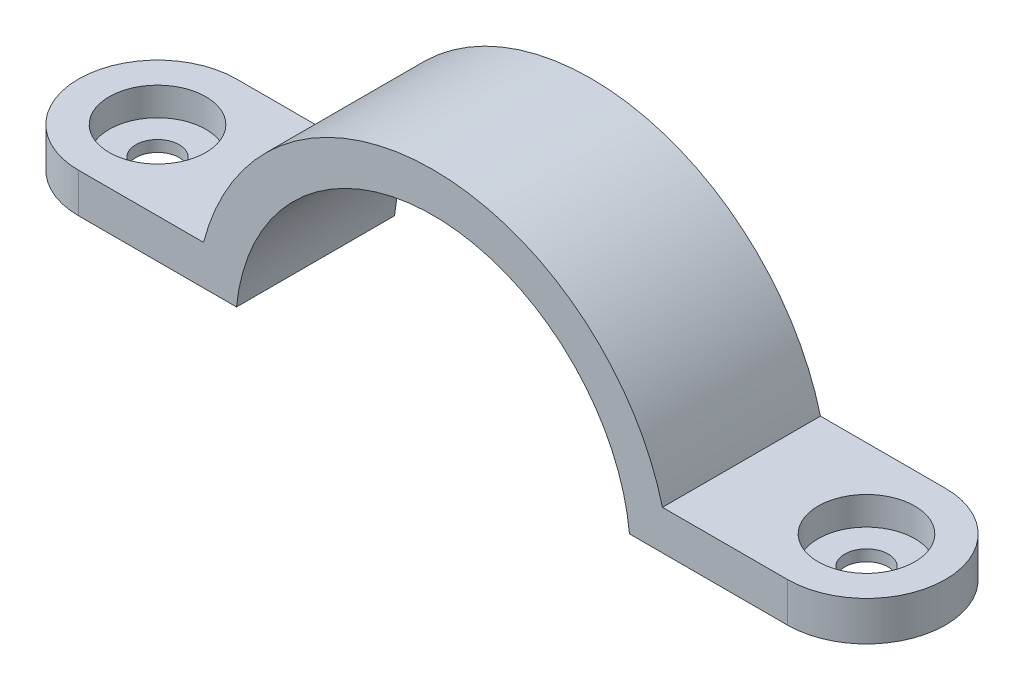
ISO-10303-21;
HEADER;
FILE_DESCRIPTION(('STEP AP214'),'2;1');
FILE_NAME('part.step','',(''),(''),'','','');
FILE_SCHEMA(('AUTOMOTIVE_DESIGN { 1 0 10303 214 1 1 1 1 }'));
ENDSEC;
DATA;
#1=APPLICATION_CONTEXT('core data for automotive mechanical design processes');
#2=APPLICATION_PROTOCOL_DEFINITION('international standard','automotive_design',2000,#1);
#3=PRODUCT_CONTEXT('',#1,'mechanical');
#4=PRODUCT('Part','Part','',(#3));
#5=PRODUCT_RELATED_PRODUCT_CATEGORY('part','',(#4));
#6=PRODUCT_DEFINITION_FORMATION('','',#4);
#7=PRODUCT_DEFINITION_CONTEXT('part definition',#1,'design');
#8=PRODUCT_DEFINITION('design','',#6,#7);
#9=PRODUCT_DEFINITION_SHAPE('','',#8);
#10=(LENGTH_UNIT() NAMED_UNIT(*) SI_UNIT(.MILLI.,.METRE.));
#11=(NAMED_UNIT(*) PLANE_ANGLE_UNIT() SI_UNIT($,.RADIAN.));
#12=(NAMED_UNIT(*) SI_UNIT($,.STERADIAN.) SOLID_ANGLE_UNIT());
#13=UNCERTAINTY_MEASURE_WITH_UNIT(LENGTH_MEASURE(1.E-05),#10,'distance_accuracy_value','');
#14=(GEOMETRIC_REPRESENTATION_CONTEXT(3) GLOBAL_UNCERTAINTY_ASSIGNED_CONTEXT((#13)) GLOBAL_UNIT_ASSIGNED_CONTEXT((#10,
#11,#12)) REPRESENTATION_CONTEXT('',''));
#15=CARTESIAN_POINT('',(0.,0.,0.));
#16=DIRECTION('',(0.,0.,1.));
#17=DIRECTION('',(1.,0.,0.));
#18=AXIS2_PLACEMENT_3D('',#15,#16,#17);
#19=CARTESIAN_POINT('',(24.8746859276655,2.5,10.));
#20=DIRECTION('',(0.,-1.,0.));
#21=DIRECTION('',(0.,0.,-1.));
#22=AXIS2_PLACEMENT_3D('',#19,#20,#21);
#23=PLANE('',#22);
#24=DIRECTION('',(-1.,0.,0.));
#25=VECTOR('',#24,1.);
#26=CARTESIAN_POINT('',(24.8746859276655,2.5,-10.));
#27=LINE('',#26,#25);
#28=CARTESIAN_POINT('',(44.8746859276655,2.5,-10.));
#29=VERTEX_POINT('',#28);
#30=CARTESIAN_POINT('',(24.8746859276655,2.5,-10.));
#31=VERTEX_POINT('',#30);
#32=EDGE_CURVE('E117',#29,#31,#27,.T.);
#33=ORIENTED_EDGE('',*,*,#32,.F.);
#34=CARTESIAN_POINT('',(44.8746859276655,2.5,0.));
#35=DIRECTION('',(0.,-1.,0.));
#36=DIRECTION('',(0.,0.,-1.));
#37=AXIS2_PLACEMENT_3D('',#34,#35,#36);
#38=CIRCLE('',#37,10.);
#39=CARTESIAN_POINT('',(44.8746859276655,2.5,10.));
#40=VERTEX_POINT('',#39);
#41=EDGE_CURVE('E150',#29,#40,#38,.T.);
#42=ORIENTED_EDGE('',*,*,#41,.T.);
#43=DIRECTION('',(-1.,0.,0.));
#44=VECTOR('',#43,1.);
#45=CARTESIAN_POINT('',(24.8746859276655,2.5,10.));
#46=LINE('',#45,#44);
#47=CARTESIAN_POINT('',(24.8746859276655,2.5,10.));
#48=VERTEX_POINT('',#47);
#49=EDGE_CURVE('E133',#40,#48,#46,.T.);
#50=ORIENTED_EDGE('',*,*,#49,.T.);
#51=DIRECTION('',(0.,0.,-1.));
#52=VECTOR('',#51,1.);
#53=CARTESIAN_POINT('',(24.8746859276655,2.5,10.));
#54=LINE('',#53,#52);
#55=EDGE_CURVE('E105',#48,#31,#54,.T.);
#56=ORIENTED_EDGE('',*,*,#55,.T.);
#57=EDGE_LOOP('',(#33,#42,#50,#56));
#58=FACE_BOUND('',#57,.T.);
#59=CARTESIAN_POINT('',(44.8746859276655,2.5,0.));
#60=DIRECTION('',(0.,1.,0.));
#61=DIRECTION('',(0.,0.,1.));
#62=AXIS2_PLACEMENT_3D('',#59,#60,#61);
#63=CIRCLE('',#62,2.75);
#64=CARTESIAN_POINT('',(44.8746859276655,2.5,2.75));
#65=VERTEX_POINT('',#64);
#66=EDGE_CURVE('E195',#65,#65,#63,.T.);
#67=ORIENTED_EDGE('',*,*,#66,.T.);
#68=EDGE_LOOP('',(#67));
#69=FACE_BOUND('',#68,.T.);
#70=ADVANCED_FACE('F33',(#58,#69),#23,.T.);
#71=CARTESIAN_POINT('',(-24.8746859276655,2.5,10.));
#72=DIRECTION('',(0.,-1.,0.));
#73=DIRECTION('',(0.,0.,-1.));
#74=AXIS2_PLACEMENT_3D('',#71,#72,#73);
#75=PLANE('',#74);
#76=DIRECTION('',(-1.,0.,0.));
#77=VECTOR('',#76,1.);
#78=CARTESIAN_POINT('',(-24.8746859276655,2.5,10.));
#79=LINE('',#78,#77);
#80=CARTESIAN_POINT('',(-24.8746859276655,2.5,10.));
#81=VERTEX_POINT('',#80);
#82=CARTESIAN_POINT('',(-44.8746859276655,2.5,10.));
#83=VERTEX_POINT('',#82);
#84=EDGE_CURVE('E130',#81,#83,#79,.T.);
#85=ORIENTED_EDGE('',*,*,#84,.T.);
#86=CARTESIAN_POINT('',(-44.8746859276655,2.5,0.));
#87=DIRECTION('',(0.,-1.,0.));
#88=DIRECTION('',(0.,0.,-1.));
#89=AXIS2_PLACEMENT_3D('',#86,#87,#88);
#90=CIRCLE('',#89,10.);
#91=CARTESIAN_POINT('',(-44.8746859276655,2.5,-10.));
#92=VERTEX_POINT('',#91);
#93=EDGE_CURVE('E11',#83,#92,#90,.T.);
#94=ORIENTED_EDGE('',*,*,#93,.T.);
#95=DIRECTION('',(-1.,0.,0.));
#96=VECTOR('',#95,1.);
#97=CARTESIAN_POINT('',(-24.8746859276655,2.5,-10.));
#98=LINE('',#97,#96);
#99=CARTESIAN_POINT('',(-24.8746859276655,2.5,-10.));
#100=VERTEX_POINT('',#99);
#101=EDGE_CURVE('E108',#100,#92,#98,.T.);
#102=ORIENTED_EDGE('',*,*,#101,.F.);
#103=DIRECTION('',(0.,0.,-1.));
#104=VECTOR('',#103,1.);
#105=CARTESIAN_POINT('',(-24.8746859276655,2.5,10.));
#106=LINE('',#105,#104);
#107=EDGE_CURVE('E96',#81,#100,#106,.T.);
#108=ORIENTED_EDGE('',*,*,#107,.F.);
#109=EDGE_LOOP('',(#85,#94,#102,#108));
#110=FACE_BOUND('',#109,.T.);
#111=CARTESIAN_POINT('',(-44.8746859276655,2.5,0.));
#112=DIRECTION('',(0.,1.,0.));
#113=DIRECTION('',(0.,0.,1.));
#114=AXIS2_PLACEMENT_3D('',#111,#112,#113);
#115=CIRCLE('',#114,2.75);
#116=CARTESIAN_POINT('',(-44.8746859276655,2.5,2.75));
#117=VERTEX_POINT('',#116);
#118=EDGE_CURVE('E183',#117,#117,#115,.T.);
#119=ORIENTED_EDGE('',*,*,#118,.T.);
#120=EDGE_LOOP('',(#119));
#121=FACE_BOUND('',#120,.T.);
#122=ADVANCED_FACE('F109',(#110,#121),#75,.T.);
#123=CARTESIAN_POINT('',(-44.8746859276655,7.5,0.));
#124=DIRECTION('',(0.,1.,0.));
#125=DIRECTION('',(0.,0.,1.));
#126=AXIS2_PLACEMENT_3D('',#123,#124,#125);
#127=CYLINDRICAL_SURFACE('',#126,10.);
#128=DIRECTION('',(0.,1.,0.));
#129=VECTOR('',#128,1.);
#130=CARTESIAN_POINT('',(-44.8746859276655,0.,10.));
#131=LINE('',#130,#129);
#132=CARTESIAN_POINT('',(-44.8746859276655,7.5,10.));
#133=VERTEX_POINT('',#132);
#134=EDGE_CURVE('E154',#133,#83,#131,.F.);
#135=ORIENTED_EDGE('',*,*,#134,.F.);
#136=CARTESIAN_POINT('',(-44.8746859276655,7.5,0.));
#137=DIRECTION('',(0.,-1.,0.));
#138=DIRECTION('',(0.,0.,-1.));
#139=AXIS2_PLACEMENT_3D('',#136,#137,#138);
#140=CIRCLE('',#139,10.);
#141=CARTESIAN_POINT('',(-44.8746859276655,7.5,-10.));
#142=VERTEX_POINT('',#141);
#143=EDGE_CURVE('E41',#142,#133,#140,.F.);
#144=ORIENTED_EDGE('',*,*,#143,.F.);
#145=DIRECTION('',(0.,-1.,0.));
#146=VECTOR('',#145,1.);
#147=CARTESIAN_POINT('',(-44.8746859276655,7.5,-10.));
#148=LINE('',#147,#146);
#149=EDGE_CURVE('E157',#92,#142,#148,.F.);
#150=ORIENTED_EDGE('',*,*,#149,.F.);
#151=ORIENTED_EDGE('',*,*,#93,.F.);
#152=EDGE_LOOP('',(#135,#144,#150,#151));
#153=FACE_BOUND('',#152,.T.);
#154=ADVANCED_FACE('F35',(#153),#127,.T.);
#155=CARTESIAN_POINT('',(44.8746859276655,2.5,0.));
#156=DIRECTION('',(0.,-1.,0.));
#157=DIRECTION('',(0.,0.,-1.));
#158=AXIS2_PLACEMENT_3D('',#155,#156,#157);
#159=CYLINDRICAL_SURFACE('',#158,10.);
#160=DIRECTION('',(0.,-1.,0.));
#161=VECTOR('',#160,1.);
#162=CARTESIAN_POINT('',(44.8746859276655,0.,10.));
#163=LINE('',#162,#161);
#164=CARTESIAN_POINT('',(44.8746859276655,7.5,10.));
#165=VERTEX_POINT('',#164);
#166=EDGE_CURVE('E104',#40,#165,#163,.F.);
#167=ORIENTED_EDGE('',*,*,#166,.F.);
#168=ORIENTED_EDGE('',*,*,#41,.F.);
#169=DIRECTION('',(0.,1.,0.));
#170=VECTOR('',#169,1.);
#171=CARTESIAN_POINT('',(44.8746859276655,2.5,-10.));
#172=LINE('',#171,#170);
#173=CARTESIAN_POINT('',(44.8746859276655,7.5,-10.));
#174=VERTEX_POINT('',#173);
#175=EDGE_CURVE('E148',#174,#29,#172,.F.);
#176=ORIENTED_EDGE('',*,*,#175,.F.);
#177=CARTESIAN_POINT('',(44.8746859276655,7.5,0.));
#178=DIRECTION('',(0.,-1.,0.));
#179=DIRECTION('',(0.,0.,-1.));
#180=AXIS2_PLACEMENT_3D('',#177,#178,#179);
#181=CIRCLE('',#180,10.);
#182=EDGE_CURVE('E152',#165,#174,#181,.F.);
#183=ORIENTED_EDGE('',*,*,#182,.F.);
#184=EDGE_LOOP('',(#167,#168,#176,#183));
#185=FACE_BOUND('',#184,.T.);
#186=ADVANCED_FACE('F228',(#185),#159,.T.);
#187=CARTESIAN_POINT('',(-24.8746859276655,7.5,10.));
#188=DIRECTION('',(0.,-1.,0.));
#189=DIRECTION('',(0.,0.,-1.));
#190=AXIS2_PLACEMENT_3D('',#187,#188,#189);
#191=PLANE('',#190);
#192=CARTESIAN_POINT('',(-44.8746859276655,7.5,0.));
#193=DIRECTION('',(0.,1.,0.));
#194=DIRECTION('',(0.,0.,1.));
#195=AXIS2_PLACEMENT_3D('',#192,#193,#194);
#196=CIRCLE('',#195,6.12);
#197=CARTESIAN_POINT('',(-44.8746859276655,7.5,6.12));
#198=VERTEX_POINT('',#197);
#199=EDGE_CURVE('E173',#198,#198,#196,.T.);
#200=ORIENTED_EDGE('',*,*,#199,.F.);
#201=EDGE_LOOP('',(#200));
#202=FACE_BOUND('',#201,.T.);
#203=DIRECTION('',(1.,0.,0.));
#204=VECTOR('',#203,1.);
#205=CARTESIAN_POINT('',(-24.8746859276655,7.5,-10.));
#206=LINE('',#205,#204);
#207=CARTESIAN_POINT('',(-29.0473750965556,7.5,-10.));
#208=VERTEX_POINT('',#207);
#209=EDGE_CURVE('E112',#208,#142,#206,.F.);
#210=ORIENTED_EDGE('',*,*,#209,.T.);
#211=ORIENTED_EDGE('',*,*,#143,.T.);
#212=DIRECTION('',(1.,0.,0.));
#213=VECTOR('',#212,1.);
#214=CARTESIAN_POINT('',(-24.8746859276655,7.5,10.));
#215=LINE('',#214,#213);
#216=CARTESIAN_POINT('',(-29.0473750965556,7.5,10.));
#217=VERTEX_POINT('',#216);
#218=EDGE_CURVE('E127',#217,#133,#215,.F.);
#219=ORIENTED_EDGE('',*,*,#218,.F.);
#220=DIRECTION('',(0.,0.,-1.));
#221=VECTOR('',#220,1.);
#222=CARTESIAN_POINT('',(-29.0473750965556,7.5,10.));
#223=LINE('',#222,#221);
#224=EDGE_CURVE('E139',#217,#208,#223,.T.);
#225=ORIENTED_EDGE('',*,*,#224,.T.);
#226=EDGE_LOOP('',(#210,#211,#219,#225));
#227=FACE_BOUND('',#226,.T.);
#228=ADVANCED_FACE('F161',(#202,#227),#191,.F.);
#229=CARTESIAN_POINT('',(0.,0.,10.));
#230=DIRECTION('',(0.,0.,-1.));
#231=DIRECTION('',(-1.,0.,0.));
#232=AXIS2_PLACEMENT_3D('',#229,#230,#231);
#233=CYLINDRICAL_SURFACE('',#232,25.);
#234=CARTESIAN_POINT('',(0.,0.,-10.));
#235=DIRECTION('',(0.,0.,1.));
#236=DIRECTION('',(1.,0.,0.));
#237=AXIS2_PLACEMENT_3D('',#234,#235,#236);
#238=CIRCLE('',#237,25.);
#239=EDGE_CURVE('E100',#31,#100,#238,.T.);
#240=ORIENTED_EDGE('',*,*,#239,.F.);
#241=ORIENTED_EDGE('',*,*,#55,.F.);
#242=CARTESIAN_POINT('',(0.,0.,10.));
#243=DIRECTION('',(0.,0.,1.));
#244=DIRECTION('',(1.,0.,0.));
#245=AXIS2_PLACEMENT_3D('',#242,#243,#244);
#246=CIRCLE('',#245,25.);
#247=EDGE_CURVE('E102',#48,#81,#246,.T.);
#248=ORIENTED_EDGE('',*,*,#247,.T.);
#249=ORIENTED_EDGE('',*,*,#107,.T.);
#250=EDGE_LOOP('',(#240,#241,#248,#249));
#251=FACE_BOUND('',#250,.T.);
#252=ADVANCED_FACE('F97',(#251),#233,.F.);
#253=CARTESIAN_POINT('',(24.8746859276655,7.5,10.));
#254=DIRECTION('',(0.,-1.,0.));
#255=DIRECTION('',(0.,0.,-1.));
#256=AXIS2_PLACEMENT_3D('',#253,#254,#255);
#257=PLANE('',#256);
#258=CARTESIAN_POINT('',(44.8746859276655,7.5,0.));
#259=DIRECTION('',(0.,1.,0.));
#260=DIRECTION('',(0.,0.,1.));
#261=AXIS2_PLACEMENT_3D('',#258,#259,#260);
#262=CIRCLE('',#261,6.12);
#263=CARTESIAN_POINT('',(44.8746859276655,7.5,6.12));
#264=VERTEX_POINT('',#263);
#265=EDGE_CURVE('E186',#264,#264,#262,.T.);
#266=ORIENTED_EDGE('',*,*,#265,.F.);
#267=EDGE_LOOP('',(#266));
#268=FACE_BOUND('',#267,.T.);
#269=DIRECTION('',(1.,0.,0.));
#270=VECTOR('',#269,1.);
#271=CARTESIAN_POINT('',(24.8746859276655,7.5,10.));
#272=LINE('',#271,#270);
#273=CARTESIAN_POINT('',(29.0473750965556,7.5,10.));
#274=VERTEX_POINT('',#273);
#275=EDGE_CURVE('E135',#165,#274,#272,.F.);
#276=ORIENTED_EDGE('',*,*,#275,.F.);
#277=ORIENTED_EDGE('',*,*,#182,.T.);
#278=DIRECTION('',(1.,0.,0.));
#279=VECTOR('',#278,1.);
#280=CARTESIAN_POINT('',(24.8746859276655,7.5,-10.));
#281=LINE('',#280,#279);
#282=CARTESIAN_POINT('',(29.0473750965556,7.5,-10.));
#283=VERTEX_POINT('',#282);
#284=EDGE_CURVE('E120',#174,#283,#281,.F.);
#285=ORIENTED_EDGE('',*,*,#284,.T.);
#286=DIRECTION('',(0.,0.,-1.));
#287=VECTOR('',#286,1.);
#288=CARTESIAN_POINT('',(29.0473750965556,7.5,10.));
#289=LINE('',#288,#287);
#290=EDGE_CURVE('E142',#274,#283,#289,.T.);
#291=ORIENTED_EDGE('',*,*,#290,.F.);
#292=EDGE_LOOP('',(#276,#277,#285,#291));
#293=FACE_BOUND('',#292,.T.);
#294=ADVANCED_FACE('F219',(#268,#293),#257,.F.);
#295=CARTESIAN_POINT('',(0.,0.,10.));
#296=DIRECTION('',(0.,0.,-1.));
#297=DIRECTION('',(-1.,0.,0.));
#298=AXIS2_PLACEMENT_3D('',#295,#296,#297);
#299=CYLINDRICAL_SURFACE('',#298,30.);
#300=CARTESIAN_POINT('',(0.,0.,-10.));
#301=DIRECTION('',(0.,0.,1.));
#302=DIRECTION('',(1.,0.,0.));
#303=AXIS2_PLACEMENT_3D('',#300,#301,#302);
#304=CIRCLE('',#303,30.);
#305=EDGE_CURVE('E125',#283,#208,#304,.T.);
#306=ORIENTED_EDGE('',*,*,#305,.T.);
#307=ORIENTED_EDGE('',*,*,#224,.F.);
#308=CARTESIAN_POINT('',(0.,0.,10.));
#309=DIRECTION('',(0.,0.,1.));
#310=DIRECTION('',(1.,0.,0.));
#311=AXIS2_PLACEMENT_3D('',#308,#309,#310);
#312=CIRCLE('',#311,30.);
#313=EDGE_CURVE('E137',#274,#217,#312,.T.);
#314=ORIENTED_EDGE('',*,*,#313,.F.);
#315=ORIENTED_EDGE('',*,*,#290,.T.);
#316=EDGE_LOOP('',(#306,#307,#314,#315));
#317=FACE_BOUND('',#316,.T.);
#318=ADVANCED_FACE('F170',(#317),#299,.T.);
#319=CARTESIAN_POINT('',(0.,0.,10.));
#320=DIRECTION('',(0.,0.,1.));
#321=DIRECTION('',(1.,0.,0.));
#322=AXIS2_PLACEMENT_3D('',#319,#320,#321);
#323=PLANE('',#322);
#324=ORIENTED_EDGE('',*,*,#218,.T.);
#325=ORIENTED_EDGE('',*,*,#134,.T.);
#326=ORIENTED_EDGE('',*,*,#84,.F.);
#327=ORIENTED_EDGE('',*,*,#247,.F.);
#328=ORIENTED_EDGE('',*,*,#49,.F.);
#329=ORIENTED_EDGE('',*,*,#166,.T.);
#330=ORIENTED_EDGE('',*,*,#275,.T.);
#331=ORIENTED_EDGE('',*,*,#313,.T.);
#332=EDGE_LOOP('',(#324,#325,#326,#327,#328,#329,#330,#331));
#333=FACE_BOUND('',#332,.T.);
#334=ADVANCED_FACE('F164',(#333),#323,.T.);
#335=CARTESIAN_POINT('',(0.,0.,-10.));
#336=DIRECTION('',(0.,0.,1.));
#337=DIRECTION('',(1.,0.,0.));
#338=AXIS2_PLACEMENT_3D('',#335,#336,#337);
#339=PLANE('',#338);
#340=ORIENTED_EDGE('',*,*,#101,.T.);
#341=ORIENTED_EDGE('',*,*,#149,.T.);
#342=ORIENTED_EDGE('',*,*,#209,.F.);
#343=ORIENTED_EDGE('',*,*,#305,.F.);
#344=ORIENTED_EDGE('',*,*,#284,.F.);
#345=ORIENTED_EDGE('',*,*,#175,.T.);
#346=ORIENTED_EDGE('',*,*,#32,.T.);
#347=ORIENTED_EDGE('',*,*,#239,.T.);
#348=EDGE_LOOP('',(#340,#341,#342,#343,#344,#345,#346,#347));
#349=FACE_BOUND('',#348,.T.);
#350=ADVANCED_FACE('F114',(#349),#339,.F.);
#351=CARTESIAN_POINT('',(-44.8746859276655,7.5,0.));
#352=DIRECTION('',(0.,1.,0.));
#353=DIRECTION('',(0.,0.,1.));
#354=AXIS2_PLACEMENT_3D('',#351,#352,#353);
#355=CYLINDRICAL_SURFACE('',#354,6.12);
#356=CARTESIAN_POINT('',(-44.8746859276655,3.92,0.));
#357=DIRECTION('',(0.,1.,0.));
#358=DIRECTION('',(0.,0.,1.));
#359=AXIS2_PLACEMENT_3D('',#356,#357,#358);
#360=CIRCLE('',#359,6.12);
#361=CARTESIAN_POINT('',(-44.8746859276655,3.92,6.12));
#362=VERTEX_POINT('',#361);
#363=EDGE_CURVE('E175',#362,#362,#360,.T.);
#364=ORIENTED_EDGE('',*,*,#363,.F.);
#365=EDGE_LOOP('',(#364));
#366=FACE_BOUND('',#365,.T.);
#367=ORIENTED_EDGE('',*,*,#199,.T.);
#368=EDGE_LOOP('',(#367));
#369=FACE_BOUND('',#368,.T.);
#370=ADVANCED_FACE('F272',(#366,#369),#355,.F.);
#371=CARTESIAN_POINT('',(-42.1246859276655,3.92,0.));
#372=DIRECTION('',(0.,-1.,0.));
#373=DIRECTION('',(0.,0.,-1.));
#374=AXIS2_PLACEMENT_3D('',#371,#372,#373);
#375=PLANE('',#374);
#376=CARTESIAN_POINT('',(-44.8746859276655,3.92,0.));
#377=DIRECTION('',(0.,1.,0.));
#378=DIRECTION('',(0.,0.,1.));
#379=AXIS2_PLACEMENT_3D('',#376,#377,#378);
#380=CIRCLE('',#379,2.75);
#381=CARTESIAN_POINT('',(-44.8746859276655,3.92,2.75));
#382=VERTEX_POINT('',#381);
#383=EDGE_CURVE('E180',#382,#382,#380,.T.);
#384=ORIENTED_EDGE('',*,*,#383,.F.);
#385=EDGE_LOOP('',(#384));
#386=FACE_BOUND('',#385,.T.);
#387=ORIENTED_EDGE('',*,*,#363,.T.);
#388=EDGE_LOOP('',(#387));
#389=FACE_BOUND('',#388,.T.);
#390=ADVANCED_FACE('F278',(#386,#389),#375,.F.);
#391=CARTESIAN_POINT('',(-44.8746859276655,7.5,0.));
#392=DIRECTION('',(0.,1.,0.));
#393=DIRECTION('',(0.,0.,1.));
#394=AXIS2_PLACEMENT_3D('',#391,#392,#393);
#395=CYLINDRICAL_SURFACE('',#394,2.75);
#396=ORIENTED_EDGE('',*,*,#118,.F.);
#397=EDGE_LOOP('',(#396));
#398=FACE_BOUND('',#397,.T.);
#399=ORIENTED_EDGE('',*,*,#383,.T.);
#400=EDGE_LOOP('',(#399));
#401=FACE_BOUND('',#400,.T.);
#402=ADVANCED_FACE('F215',(#398,#401),#395,.F.);
#403=CARTESIAN_POINT('',(44.8746859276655,7.5,0.));
#404=DIRECTION('',(0.,1.,0.));
#405=DIRECTION('',(0.,0.,1.));
#406=AXIS2_PLACEMENT_3D('',#403,#404,#405);
#407=CYLINDRICAL_SURFACE('',#406,6.12);
#408=CARTESIAN_POINT('',(44.8746859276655,3.92,0.));
#409=DIRECTION('',(0.,1.,0.));
#410=DIRECTION('',(0.,0.,1.));
#411=AXIS2_PLACEMENT_3D('',#408,#409,#410);
#412=CIRCLE('',#411,6.12);
#413=CARTESIAN_POINT('',(44.8746859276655,3.92,6.12));
#414=VERTEX_POINT('',#413);
#415=EDGE_CURVE('E189',#414,#414,#412,.T.);
#416=ORIENTED_EDGE('',*,*,#415,.F.);
#417=EDGE_LOOP('',(#416));
#418=FACE_BOUND('',#417,.T.);
#419=ORIENTED_EDGE('',*,*,#265,.T.);
#420=EDGE_LOOP('',(#419));
#421=FACE_BOUND('',#420,.T.);
#422=ADVANCED_FACE('F209',(#418,#421),#407,.F.);
#423=CARTESIAN_POINT('',(47.6246859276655,3.92,0.));
#424=DIRECTION('',(0.,-1.,0.));
#425=DIRECTION('',(0.,0.,-1.));
#426=AXIS2_PLACEMENT_3D('',#423,#424,#425);
#427=PLANE('',#426);
#428=CARTESIAN_POINT('',(44.8746859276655,3.92,0.));
#429=DIRECTION('',(0.,1.,0.));
#430=DIRECTION('',(0.,0.,1.));
#431=AXIS2_PLACEMENT_3D('',#428,#429,#430);
#432=CIRCLE('',#431,2.75);
#433=CARTESIAN_POINT('',(44.8746859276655,3.92,2.75));
#434=VERTEX_POINT('',#433);
#435=EDGE_CURVE('E192',#434,#434,#432,.T.);
#436=ORIENTED_EDGE('',*,*,#435,.F.);
#437=EDGE_LOOP('',(#436));
#438=FACE_BOUND('',#437,.T.);
#439=ORIENTED_EDGE('',*,*,#415,.T.);
#440=EDGE_LOOP('',(#439));
#441=FACE_BOUND('',#440,.T.);
#442=ADVANCED_FACE('F203',(#438,#441),#427,.F.);
#443=CARTESIAN_POINT('',(44.8746859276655,7.5,0.));
#444=DIRECTION('',(0.,1.,0.));
#445=DIRECTION('',(0.,0.,1.));
#446=AXIS2_PLACEMENT_3D('',#443,#444,#445);
#447=CYLINDRICAL_SURFACE('',#446,2.75);
#448=ORIENTED_EDGE('',*,*,#66,.F.);
#449=EDGE_LOOP('',(#448));
#450=FACE_BOUND('',#449,.T.);
#451=ORIENTED_EDGE('',*,*,#435,.T.);
#452=EDGE_LOOP('',(#451));
#453=FACE_BOUND('',#452,.T.);
#454=ADVANCED_FACE('F200',(#450,#453),#447,.F.);
#455=CLOSED_SHELL('',(#70,#122,#154,#186,#228,#252,#294,#318,#334,#350,#370,#390,#402,#422,#442,#454));
#456=MANIFOLD_SOLID_BREP('B2',#455);
#457=ADVANCED_BREP_SHAPE_REPRESENTATION('',(#18,#456),#14);
#458=SHAPE_DEFINITION_REPRESENTATION(#9,#457);
ENDSEC;
END-ISO-10303-21;
